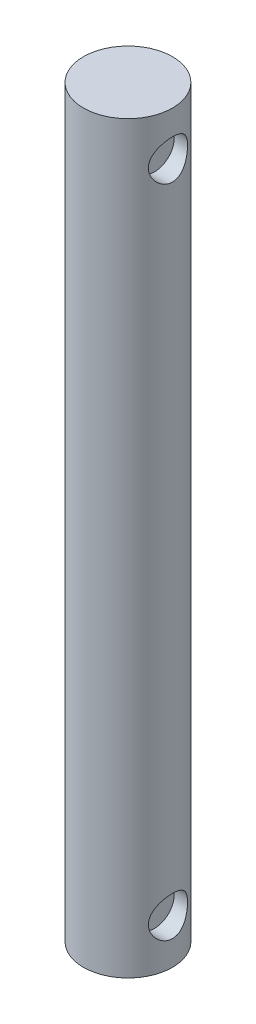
from build123d import *

# Parameters (mm, degrees)
SKETCH_1_R          = 2.5
EXTRUDE_1_DEPTH     = 41.8
SKETCH_6_R          = 1.1
CUT_EXTRUDE_1_DEPTH = 1


with BuildPart() as part:
    # Sketch 1 → Extrude 1 (new body)
    with BuildSketch(Plane(origin=(0, 0, 0), x_dir=(1, 0, 0), z_dir=(0, 1, 0))):
        with Locations(Location((0, 0, 0), (0, 0, 270))):
            Circle(SKETCH_1_R)
    extrude(amount=EXTRUDE_1_DEPTH)

    # Sketch 6 → Cut-Extrude 1 (cut)
    with BuildSketch(Plane(origin=(2.5, 0, 0), x_dir=(0, 0, -1), z_dir=(1, 0, 0))):
        with Locations((0, 39.3)):
            Circle(SKETCH_6_R)
        with Locations((0, 2.5)):
            Circle(SKETCH_6_R)
    extrude(amount=-CUT_EXTRUDE_1_DEPTH, mode=Mode.SUBTRACT)


solid = part.part
